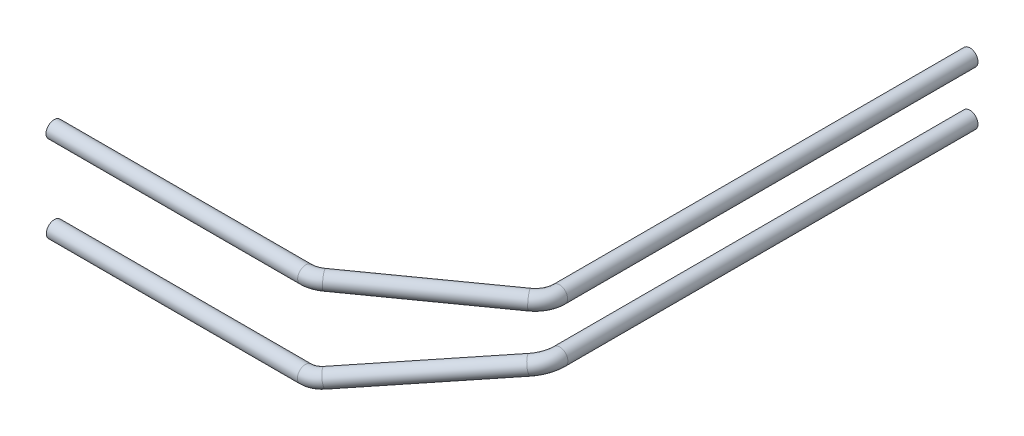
ISO-10303-21;
HEADER;
FILE_DESCRIPTION(('STEP AP214'),'2;1');
FILE_NAME('part.step','',(''),(''),'','','');
FILE_SCHEMA(('AUTOMOTIVE_DESIGN { 1 0 10303 214 1 1 1 1 }'));
ENDSEC;
DATA;
#1=APPLICATION_CONTEXT('core data for automotive mechanical design processes');
#2=APPLICATION_PROTOCOL_DEFINITION('international standard','automotive_design',2000,#1);
#3=PRODUCT_CONTEXT('',#1,'mechanical');
#4=PRODUCT('Part','Part','',(#3));
#5=PRODUCT_RELATED_PRODUCT_CATEGORY('part','',(#4));
#6=PRODUCT_DEFINITION_FORMATION('','',#4);
#7=PRODUCT_DEFINITION_CONTEXT('part definition',#1,'design');
#8=PRODUCT_DEFINITION('design','',#6,#7);
#9=PRODUCT_DEFINITION_SHAPE('','',#8);
#10=(LENGTH_UNIT() NAMED_UNIT(*) SI_UNIT(.MILLI.,.METRE.));
#11=(NAMED_UNIT(*) PLANE_ANGLE_UNIT() SI_UNIT($,.RADIAN.));
#12=(NAMED_UNIT(*) SI_UNIT($,.STERADIAN.) SOLID_ANGLE_UNIT());
#13=UNCERTAINTY_MEASURE_WITH_UNIT(LENGTH_MEASURE(1.E-05),#10,'distance_accuracy_value','');
#14=(GEOMETRIC_REPRESENTATION_CONTEXT(3) GLOBAL_UNCERTAINTY_ASSIGNED_CONTEXT((#13)) GLOBAL_UNIT_ASSIGNED_CONTEXT((#10,
#11,#12)) REPRESENTATION_CONTEXT('',''));
#15=CARTESIAN_POINT('',(0.,0.,0.));
#16=DIRECTION('',(0.,0.,1.));
#17=DIRECTION('',(1.,0.,0.));
#18=AXIS2_PLACEMENT_3D('',#15,#16,#17);
#19=CARTESIAN_POINT('',(295.260101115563,-76.2,635.));
#20=DIRECTION('',(-1.,0.,0.));
#21=DIRECTION('',(0.,-1.,0.));
#22=AXIS2_PLACEMENT_3D('',#19,#20,#21);
#23=CYLINDRICAL_SURFACE('',#22,17.399);
#24=CARTESIAN_POINT('',(-295.260101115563,-76.2,635.));
#25=DIRECTION('',(1.,0.,0.));
#26=DIRECTION('',(0.,1.,0.));
#27=AXIS2_PLACEMENT_3D('',#24,#25,#26);
#28=CIRCLE('',#27,17.399);
#29=CARTESIAN_POINT('',(-295.260101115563,-58.801,635.));
#30=VERTEX_POINT('',#29);
#31=EDGE_CURVE('E64',#30,#30,#28,.T.);
#32=ORIENTED_EDGE('',*,*,#31,.F.);
#33=EDGE_LOOP('',(#32));
#34=FACE_BOUND('',#33,.T.);
#35=CARTESIAN_POINT('',(295.260101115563,-76.2,635.));
#36=DIRECTION('',(-1.,0.,0.));
#37=DIRECTION('',(0.,-1.,0.));
#38=AXIS2_PLACEMENT_3D('',#35,#36,#37);
#39=CIRCLE('',#38,17.399);
#40=CARTESIAN_POINT('',(295.260101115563,-81.702046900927,651.506140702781));
#41=VERTEX_POINT('',#40);
#42=EDGE_CURVE('E72',#41,#41,#39,.T.);
#43=ORIENTED_EDGE('',*,*,#42,.F.);
#44=EDGE_LOOP('',(#43));
#45=FACE_BOUND('',#44,.T.);
#46=ADVANCED_FACE('F57',(#34,#45),#23,.F.);
#47=CARTESIAN_POINT('',(295.260101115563,-76.2,635.));
#48=DIRECTION('',(-1.,0.,0.));
#49=DIRECTION('',(0.,-1.,0.));
#50=AXIS2_PLACEMENT_3D('',#47,#48,#49);
#51=CYLINDRICAL_SURFACE('',#50,19.05);
#52=CARTESIAN_POINT('',(-295.260101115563,-76.2,635.));
#53=DIRECTION('',(1.,0.,0.));
#54=DIRECTION('',(0.,1.,0.));
#55=AXIS2_PLACEMENT_3D('',#52,#53,#54);
#56=CIRCLE('',#55,19.05);
#57=CARTESIAN_POINT('',(-295.260101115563,-57.1499999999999,635.));
#58=VERTEX_POINT('',#57);
#59=EDGE_CURVE('E68',#58,#58,#56,.T.);
#60=ORIENTED_EDGE('',*,*,#59,.T.);
#61=EDGE_LOOP('',(#60));
#62=FACE_BOUND('',#61,.T.);
#63=CARTESIAN_POINT('',(295.260101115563,-76.2,635.));
#64=DIRECTION('',(1.,0.,0.));
#65=DIRECTION('',(0.,1.,0.));
#66=AXIS2_PLACEMENT_3D('',#63,#64,#65);
#67=CIRCLE('',#66,19.05);
#68=CARTESIAN_POINT('',(295.260101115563,-82.2241389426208,653.072416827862));
#69=VERTEX_POINT('',#68);
#70=EDGE_CURVE('E12',#69,#69,#67,.T.);
#71=ORIENTED_EDGE('',*,*,#70,.F.);
#72=EDGE_LOOP('',(#71));
#73=FACE_BOUND('',#72,.T.);
#74=ADVANCED_FACE('F59',(#62,#73),#51,.T.);
#75=CARTESIAN_POINT('',(-295.260101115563,-76.2,635.));
#76=DIRECTION('',(1.,0.,0.));
#77=DIRECTION('',(0.,1.,0.));
#78=AXIS2_PLACEMENT_3D('',#75,#76,#77);
#79=PLANE('',#78);
#80=ORIENTED_EDGE('',*,*,#31,.T.);
#81=EDGE_LOOP('',(#80));
#82=FACE_BOUND('',#81,.T.);
#83=ORIENTED_EDGE('',*,*,#59,.F.);
#84=EDGE_LOOP('',(#83));
#85=FACE_BOUND('',#84,.T.);
#86=ADVANCED_FACE('F135',(#82,#85),#79,.F.);
#87=CARTESIAN_POINT('',(295.260101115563,-58.1275831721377,580.782749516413));
#88=DIRECTION('',(0.,0.948683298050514,0.316227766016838));
#89=DIRECTION('',(0.,-0.316227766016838,0.948683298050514));
#90=AXIS2_PLACEMENT_3D('',#87,#88,#89);
#91=TOROIDAL_SURFACE('',#90,57.15,17.399);
#92=CARTESIAN_POINT('',(329.592988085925,-72.5753351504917,624.126005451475));
#93=DIRECTION('',(-0.79943662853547,-0.189973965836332,0.569921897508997));
#94=DIRECTION('',(0.580493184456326,0.,0.814265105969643));
#95=AXIS2_PLACEMENT_3D('',#92,#93,#94);
#96=CIRCLE('',#95,17.399);
#97=CARTESIAN_POINT('',(340.045444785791,-76.9738729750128,637.321618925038));
#98=VERTEX_POINT('',#97);
#99=EDGE_CURVE('E78',#98,#98,#96,.T.);
#100=CARTESIAN_POINT('',(295.260101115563,-58.1275831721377,580.782749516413));
#101=DIRECTION('',(0.,0.948683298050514,0.316227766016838));
#102=DIRECTION('',(0.,-0.316227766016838,0.948683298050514));
#103=AXIS2_PLACEMENT_3D('',#100,#101,#102);
#104=CIRCLE('',#103,74.549);
#105=EDGE_CURVE('',#41,#98,#104,.T.);
#106=ORIENTED_EDGE('',*,*,#42,.T.);
#107=ORIENTED_EDGE('',*,*,#99,.F.);
#108=ORIENTED_EDGE('',*,*,#105,.T.);
#109=ORIENTED_EDGE('',*,*,#105,.F.);
#110=EDGE_LOOP('',(#106,#108,#107,#109));
#111=FACE_BOUND('',#110,.T.);
#112=ADVANCED_FACE('F127',(#111),#91,.F.);
#113=CARTESIAN_POINT('',(295.260101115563,-58.1275831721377,580.782749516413));
#114=DIRECTION('',(0.,0.948683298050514,0.316227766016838));
#115=DIRECTION('',(0.,-0.316227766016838,0.948683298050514));
#116=AXIS2_PLACEMENT_3D('',#113,#114,#115);
#117=TOROIDAL_SURFACE('',#116,57.15,19.05);
#118=CARTESIAN_POINT('',(329.592988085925,-72.5753351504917,624.126005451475));
#119=DIRECTION('',(-0.79943662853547,-0.189973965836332,0.569921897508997));
#120=DIRECTION('',(0.580493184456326,0.,0.814265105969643));
#121=AXIS2_PLACEMENT_3D('',#118,#119,#120);
#122=CIRCLE('',#121,19.05);
#123=CARTESIAN_POINT('',(341.037283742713,-77.3912524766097,638.573757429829));
#124=VERTEX_POINT('',#123);
#125=EDGE_CURVE('E77',#124,#124,#122,.T.);
#126=CARTESIAN_POINT('',(295.260101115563,-58.1275831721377,580.782749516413));
#127=DIRECTION('',(0.,0.948683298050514,0.316227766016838));
#128=DIRECTION('',(0.,-0.316227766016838,0.948683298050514));
#129=AXIS2_PLACEMENT_3D('',#126,#127,#128);
#130=CIRCLE('',#129,76.2);
#131=EDGE_CURVE('',#69,#124,#130,.T.);
#132=ORIENTED_EDGE('',*,*,#70,.T.);
#133=ORIENTED_EDGE('',*,*,#125,.T.);
#134=ORIENTED_EDGE('',*,*,#131,.T.);
#135=ORIENTED_EDGE('',*,*,#131,.F.);
#136=EDGE_LOOP('',(#132,#134,#133,#135));
#137=FACE_BOUND('',#136,.T.);
#138=ADVANCED_FACE('F125',(#137),#117,.T.);
#139=CARTESIAN_POINT('',(611.086952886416,-5.6825722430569,423.447716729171));
#140=DIRECTION('',(-0.79943662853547,-0.189973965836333,0.569921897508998));
#141=DIRECTION('',(0.580493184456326,0.,0.814265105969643));
#142=AXIS2_PLACEMENT_3D('',#139,#140,#141);
#143=CYLINDRICAL_SURFACE('',#142,17.399);
#144=CARTESIAN_POINT('',(611.086952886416,-5.68257224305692,423.447716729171));
#145=DIRECTION('',(-0.79943662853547,-0.189973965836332,0.569921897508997));
#146=DIRECTION('',(0.580493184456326,0.,0.814265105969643));
#147=AXIS2_PLACEMENT_3D('',#144,#145,#146);
#148=CIRCLE('',#147,17.399);
#149=CARTESIAN_POINT('',(620.734368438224,-3.3900105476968,437.744455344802));
#150=VERTEX_POINT('',#149);
#151=EDGE_CURVE('E82',#150,#150,#148,.F.);
#152=ORIENTED_EDGE('',*,*,#151,.T.);
#153=EDGE_LOOP('',(#152));
#154=FACE_BOUND('',#153,.T.);
#155=ORIENTED_EDGE('',*,*,#99,.T.);
#156=EDGE_LOOP('',(#155));
#157=FACE_BOUND('',#156,.T.);
#158=ADVANCED_FACE('F121',(#154,#157),#143,.F.);
#159=CARTESIAN_POINT('',(611.086952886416,-5.6825722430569,423.447716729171));
#160=DIRECTION('',(-0.79943662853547,-0.189973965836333,0.569921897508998));
#161=DIRECTION('',(0.580493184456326,0.,0.814265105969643));
#162=AXIS2_PLACEMENT_3D('',#159,#160,#161);
#163=CYLINDRICAL_SURFACE('',#162,19.05);
#164=CARTESIAN_POINT('',(611.086952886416,-5.68257224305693,423.447716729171));
#165=DIRECTION('',(0.79943662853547,0.189973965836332,-0.569921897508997));
#166=DIRECTION('',(-0.580493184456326,0.,-0.814265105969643));
#167=AXIS2_PLACEMENT_3D('',#164,#165,#166);
#168=CIRCLE('',#167,19.05);
#169=CARTESIAN_POINT('',(621.649816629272,-3.1724681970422,439.101080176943));
#170=VERTEX_POINT('',#169);
#171=EDGE_CURVE('E81',#170,#170,#168,.T.);
#172=ORIENTED_EDGE('',*,*,#171,.F.);
#173=EDGE_LOOP('',(#172));
#174=FACE_BOUND('',#173,.T.);
#175=ORIENTED_EDGE('',*,*,#125,.F.);
#176=EDGE_LOOP('',(#175));
#177=FACE_BOUND('',#176,.T.);
#178=ADVANCED_FACE('F118',(#174,#177),#163,.T.);
#179=CARTESIAN_POINT('',(579.398361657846,-13.2128843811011,376.487626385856));
#180=DIRECTION('',(0.231196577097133,-0.972907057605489,0.));
#181=DIRECTION('',(0.972907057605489,0.231196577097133,0.));
#182=AXIS2_PLACEMENT_3D('',#179,#180,#181);
#183=TOROIDAL_SURFACE('',#182,57.1499999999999,17.399);
#184=CARTESIAN_POINT('',(635.,0.,376.487626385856));
#185=DIRECTION('',(0.,0.,-1.));
#186=DIRECTION('',(-1.,0.,0.));
#187=AXIS2_PLACEMENT_3D('',#184,#185,#186);
#188=CIRCLE('',#187,17.399);
#189=CARTESIAN_POINT('',(651.927609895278,4.02258924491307,376.487626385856));
#190=VERTEX_POINT('',#189);
#191=EDGE_CURVE('E89',#190,#190,#188,.F.);
#192=CARTESIAN_POINT('',(579.398361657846,-13.2128843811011,376.487626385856));
#193=DIRECTION('',(0.231196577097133,-0.972907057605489,0.));
#194=DIRECTION('',(0.972907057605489,0.231196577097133,0.));
#195=AXIS2_PLACEMENT_3D('',#192,#193,#194);
#196=CIRCLE('',#195,74.5489999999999);
#197=EDGE_CURVE('',#190,#150,#196,.T.);
#198=ORIENTED_EDGE('',*,*,#191,.F.);
#199=ORIENTED_EDGE('',*,*,#151,.F.);
#200=ORIENTED_EDGE('',*,*,#197,.T.);
#201=ORIENTED_EDGE('',*,*,#197,.F.);
#202=EDGE_LOOP('',(#198,#200,#199,#201));
#203=FACE_BOUND('',#202,.T.);
#204=ADVANCED_FACE('F114',(#203),#183,.F.);
#205=CARTESIAN_POINT('',(579.398361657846,-13.2128843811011,376.487626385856));
#206=DIRECTION('',(0.231196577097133,-0.972907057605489,0.));
#207=DIRECTION('',(0.972907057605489,0.231196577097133,0.));
#208=AXIS2_PLACEMENT_3D('',#205,#206,#207);
#209=TOROIDAL_SURFACE('',#208,57.1499999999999,19.05);
#210=CARTESIAN_POINT('',(635.,0.,376.487626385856));
#211=DIRECTION('',(0.,0.,-1.));
#212=DIRECTION('',(-1.,0.,0.));
#213=AXIS2_PLACEMENT_3D('',#210,#211,#212);
#214=CIRCLE('',#213,19.05);
#215=CARTESIAN_POINT('',(653.533879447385,4.40429479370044,376.487626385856));
#216=VERTEX_POINT('',#215);
#217=EDGE_CURVE('E90',#216,#216,#214,.T.);
#218=CARTESIAN_POINT('',(579.398361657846,-13.2128843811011,376.487626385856));
#219=DIRECTION('',(0.231196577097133,-0.972907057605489,0.));
#220=DIRECTION('',(0.972907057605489,0.231196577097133,0.));
#221=AXIS2_PLACEMENT_3D('',#218,#219,#220);
#222=CIRCLE('',#221,76.2);
#223=EDGE_CURVE('',#216,#170,#222,.T.);
#224=ORIENTED_EDGE('',*,*,#217,.F.);
#225=ORIENTED_EDGE('',*,*,#171,.T.);
#226=ORIENTED_EDGE('',*,*,#223,.T.);
#227=ORIENTED_EDGE('',*,*,#223,.F.);
#228=EDGE_LOOP('',(#224,#226,#225,#227));
#229=FACE_BOUND('',#228,.T.);
#230=ADVANCED_FACE('F111',(#229),#209,.T.);
#231=CARTESIAN_POINT('',(635.,0.,-588.434813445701));
#232=DIRECTION('',(0.,0.,1.));
#233=DIRECTION('',(0.,-1.,0.));
#234=AXIS2_PLACEMENT_3D('',#231,#232,#233);
#235=CYLINDRICAL_SURFACE('',#234,17.399);
#236=CARTESIAN_POINT('',(635.,0.,-588.434813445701));
#237=DIRECTION('',(0.,0.,-1.));
#238=DIRECTION('',(-0.159334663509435,0.987224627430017,0.));
#239=AXIS2_PLACEMENT_3D('',#236,#237,#238);
#240=CIRCLE('',#239,17.399);
#241=CARTESIAN_POINT('',(632.227736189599,17.1767212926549,-588.434813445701));
#242=VERTEX_POINT('',#241);
#243=EDGE_CURVE('E96',#242,#242,#240,.T.);
#244=ORIENTED_EDGE('',*,*,#243,.T.);
#245=EDGE_LOOP('',(#244));
#246=FACE_BOUND('',#245,.T.);
#247=ORIENTED_EDGE('',*,*,#191,.T.);
#248=EDGE_LOOP('',(#247));
#249=FACE_BOUND('',#248,.T.);
#250=ADVANCED_FACE('F107',(#246,#249),#235,.F.);
#251=CARTESIAN_POINT('',(635.,0.,-588.434813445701));
#252=DIRECTION('',(0.,0.,1.));
#253=DIRECTION('',(0.,-1.,0.));
#254=AXIS2_PLACEMENT_3D('',#251,#252,#253);
#255=CYLINDRICAL_SURFACE('',#254,19.05);
#256=CARTESIAN_POINT('',(635.,0.,-588.434813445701));
#257=DIRECTION('',(0.,0.,-1.));
#258=DIRECTION('',(-0.159334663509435,0.987224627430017,0.));
#259=AXIS2_PLACEMENT_3D('',#256,#257,#258);
#260=CIRCLE('',#259,19.05);
#261=CARTESIAN_POINT('',(631.964674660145,18.8066291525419,-588.434813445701));
#262=VERTEX_POINT('',#261);
#263=EDGE_CURVE('E93',#262,#262,#260,.T.);
#264=ORIENTED_EDGE('',*,*,#263,.F.);
#265=EDGE_LOOP('',(#264));
#266=FACE_BOUND('',#265,.T.);
#267=ORIENTED_EDGE('',*,*,#217,.T.);
#268=EDGE_LOOP('',(#267));
#269=FACE_BOUND('',#268,.T.);
#270=ADVANCED_FACE('F104',(#266,#269),#255,.T.);
#271=CARTESIAN_POINT('',(635.,0.,-588.434813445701));
#272=DIRECTION('',(0.,0.,-1.));
#273=DIRECTION('',(-0.159334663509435,0.987224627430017,0.));
#274=AXIS2_PLACEMENT_3D('',#271,#272,#273);
#275=PLANE('',#274);
#276=ORIENTED_EDGE('',*,*,#243,.F.);
#277=EDGE_LOOP('',(#276));
#278=FACE_BOUND('',#277,.T.);
#279=ORIENTED_EDGE('',*,*,#263,.T.);
#280=EDGE_LOOP('',(#279));
#281=FACE_BOUND('',#280,.T.);
#282=ADVANCED_FACE('F102',(#278,#281),#275,.T.);
#283=CLOSED_SHELL('',(#46,#74,#86,#112,#138,#158,#178,#204,#230,#250,#270,#282));
#284=MANIFOLD_SOLID_BREP('B2',#283);
#285=CARTESIAN_POINT('',(296.054155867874,127.,635.));
#286=DIRECTION('',(-1.,0.,0.));
#287=DIRECTION('',(0.,-1.,0.));
#288=AXIS2_PLACEMENT_3D('',#285,#286,#287);
#289=CYLINDRICAL_SURFACE('',#288,17.399);
#290=CARTESIAN_POINT('',(-296.006811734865,127.,635.));
#291=DIRECTION('',(1.,0.,0.));
#292=DIRECTION('',(0.,1.,0.));
#293=AXIS2_PLACEMENT_3D('',#290,#291,#292);
#294=CIRCLE('',#293,17.399);
#295=CARTESIAN_POINT('',(-296.006811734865,144.399,635.));
#296=VERTEX_POINT('',#295);
#297=EDGE_CURVE('E294',#296,#296,#294,.T.);
#298=ORIENTED_EDGE('',*,*,#297,.F.);
#299=EDGE_LOOP('',(#298));
#300=FACE_BOUND('',#299,.T.);
#301=CARTESIAN_POINT('',(296.054155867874,127.,635.));
#302=DIRECTION('',(-1.,0.,0.));
#303=DIRECTION('',(0.,-1.,0.));
#304=AXIS2_PLACEMENT_3D('',#301,#302,#303);
#305=CIRCLE('',#304,17.399);
#306=CARTESIAN_POINT('',(296.054155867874,127.,652.399));
#307=VERTEX_POINT('',#306);
#308=EDGE_CURVE('E302',#307,#307,#305,.T.);
#309=ORIENTED_EDGE('',*,*,#308,.F.);
#310=EDGE_LOOP('',(#309));
#311=FACE_BOUND('',#310,.T.);
#312=ADVANCED_FACE('F287',(#300,#311),#289,.F.);
#313=CARTESIAN_POINT('',(296.054155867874,127.,635.));
#314=DIRECTION('',(-1.,0.,0.));
#315=DIRECTION('',(0.,-1.,0.));
#316=AXIS2_PLACEMENT_3D('',#313,#314,#315);
#317=CYLINDRICAL_SURFACE('',#316,19.05);
#318=CARTESIAN_POINT('',(-296.006811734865,127.,635.));
#319=DIRECTION('',(1.,0.,0.));
#320=DIRECTION('',(0.,1.,0.));
#321=AXIS2_PLACEMENT_3D('',#318,#319,#320);
#322=CIRCLE('',#321,19.05);
#323=CARTESIAN_POINT('',(-296.006811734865,146.05,635.));
#324=VERTEX_POINT('',#323);
#325=EDGE_CURVE('E298',#324,#324,#322,.T.);
#326=ORIENTED_EDGE('',*,*,#325,.T.);
#327=EDGE_LOOP('',(#326));
#328=FACE_BOUND('',#327,.T.);
#329=CARTESIAN_POINT('',(296.054155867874,127.,635.));
#330=DIRECTION('',(1.,0.,0.));
#331=DIRECTION('',(0.,1.,0.));
#332=AXIS2_PLACEMENT_3D('',#329,#330,#331);
#333=CIRCLE('',#332,19.05);
#334=CARTESIAN_POINT('',(296.054155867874,127.,654.05));
#335=VERTEX_POINT('',#334);
#336=EDGE_CURVE('E56',#335,#335,#333,.T.);
#337=ORIENTED_EDGE('',*,*,#336,.F.);
#338=EDGE_LOOP('',(#337));
#339=FACE_BOUND('',#338,.T.);
#340=ADVANCED_FACE('F289',(#328,#339),#317,.T.);
#341=CARTESIAN_POINT('',(-296.006811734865,127.,635.));
#342=DIRECTION('',(1.,0.,0.));
#343=DIRECTION('',(0.,1.,0.));
#344=AXIS2_PLACEMENT_3D('',#341,#342,#343);
#345=PLANE('',#344);
#346=ORIENTED_EDGE('',*,*,#297,.T.);
#347=EDGE_LOOP('',(#346));
#348=FACE_BOUND('',#347,.T.);
#349=ORIENTED_EDGE('',*,*,#325,.F.);
#350=EDGE_LOOP('',(#349));
#351=FACE_BOUND('',#350,.T.);
#352=ADVANCED_FACE('F365',(#348,#351),#345,.F.);
#353=CARTESIAN_POINT('',(296.054155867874,127.,577.85));
#354=DIRECTION('',(0.,1.,0.));
#355=DIRECTION('',(0.,0.,1.));
#356=AXIS2_PLACEMENT_3D('',#353,#354,#355);
#357=TOROIDAL_SURFACE('',#356,57.15,17.399);
#358=CARTESIAN_POINT('',(329.229341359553,127.,624.385250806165));
#359=DIRECTION('',(-0.814265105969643,0.,0.580493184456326));
#360=DIRECTION('',(0.580493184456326,0.,0.814265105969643));
#361=AXIS2_PLACEMENT_3D('',#358,#359,#360);
#362=CIRCLE('',#361,17.399);
#363=CARTESIAN_POINT('',(339.329342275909,127.,638.552649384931));
#364=VERTEX_POINT('',#363);
#365=EDGE_CURVE('E308',#364,#364,#362,.T.);
#366=CARTESIAN_POINT('',(296.054155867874,127.,577.85));
#367=DIRECTION('',(0.,1.,0.));
#368=DIRECTION('',(0.,0.,1.));
#369=AXIS2_PLACEMENT_3D('',#366,#367,#368);
#370=CIRCLE('',#369,74.5490000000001);
#371=EDGE_CURVE('',#307,#364,#370,.T.);
#372=ORIENTED_EDGE('',*,*,#308,.T.);
#373=ORIENTED_EDGE('',*,*,#365,.F.);
#374=ORIENTED_EDGE('',*,*,#371,.T.);
#375=ORIENTED_EDGE('',*,*,#371,.F.);
#376=EDGE_LOOP('',(#372,#374,#373,#375));
#377=FACE_BOUND('',#376,.T.);
#378=ADVANCED_FACE('F357',(#377),#357,.F.);
#379=CARTESIAN_POINT('',(296.054155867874,127.,577.85));
#380=DIRECTION('',(0.,1.,0.));
#381=DIRECTION('',(0.,0.,1.));
#382=AXIS2_PLACEMENT_3D('',#379,#380,#381);
#383=TOROIDAL_SURFACE('',#382,57.15,19.05);
#384=CARTESIAN_POINT('',(329.229341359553,127.,624.385250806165));
#385=DIRECTION('',(-0.814265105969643,0.,0.580493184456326));
#386=DIRECTION('',(0.580493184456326,0.,0.814265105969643));
#387=AXIS2_PLACEMENT_3D('',#384,#385,#386);
#388=CIRCLE('',#387,19.05);
#389=CARTESIAN_POINT('',(340.287736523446,127.,639.897001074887));
#390=VERTEX_POINT('',#389);
#391=EDGE_CURVE('E307',#390,#390,#388,.T.);
#392=CARTESIAN_POINT('',(296.054155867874,127.,577.85));
#393=DIRECTION('',(0.,1.,0.));
#394=DIRECTION('',(0.,0.,1.));
#395=AXIS2_PLACEMENT_3D('',#392,#393,#394);
#396=CIRCLE('',#395,76.2000000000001);
#397=EDGE_CURVE('',#335,#390,#396,.T.);
#398=ORIENTED_EDGE('',*,*,#336,.T.);
#399=ORIENTED_EDGE('',*,*,#391,.T.);
#400=ORIENTED_EDGE('',*,*,#397,.T.);
#401=ORIENTED_EDGE('',*,*,#397,.F.);
#402=EDGE_LOOP('',(#398,#400,#399,#401));
#403=FACE_BOUND('',#402,.T.);
#404=ADVANCED_FACE('F355',(#403),#383,.T.);
#405=CARTESIAN_POINT('',(611.025185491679,127.,423.491750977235));
#406=DIRECTION('',(-0.814265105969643,0.,0.580493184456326));
#407=DIRECTION('',(0.580493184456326,0.,0.814265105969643));
#408=AXIS2_PLACEMENT_3D('',#405,#406,#407);
#409=CYLINDRICAL_SURFACE('',#408,17.399);
#410=CARTESIAN_POINT('',(611.025185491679,127.,423.491750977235));
#411=DIRECTION('',(-0.814265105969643,0.,0.580493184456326));
#412=DIRECTION('',(0.580493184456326,0.,0.814265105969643));
#413=AXIS2_PLACEMENT_3D('',#410,#411,#412);
#414=CIRCLE('',#413,17.399);
#415=CARTESIAN_POINT('',(621.125186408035,127.,437.659149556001));
#416=VERTEX_POINT('',#415);
#417=EDGE_CURVE('E312',#416,#416,#414,.T.);
#418=ORIENTED_EDGE('',*,*,#417,.F.);
#419=EDGE_LOOP('',(#418));
#420=FACE_BOUND('',#419,.T.);
#421=ORIENTED_EDGE('',*,*,#365,.T.);
#422=EDGE_LOOP('',(#421));
#423=FACE_BOUND('',#422,.T.);
#424=ADVANCED_FACE('F351',(#420,#423),#409,.F.);
#425=CARTESIAN_POINT('',(611.025185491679,127.,423.491750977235));
#426=DIRECTION('',(-0.814265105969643,0.,0.580493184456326));
#427=DIRECTION('',(0.580493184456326,0.,0.814265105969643));
#428=AXIS2_PLACEMENT_3D('',#425,#426,#427);
#429=CYLINDRICAL_SURFACE('',#428,19.05);
#430=CARTESIAN_POINT('',(611.025185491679,127.,423.491750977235));
#431=DIRECTION('',(0.814265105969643,0.,-0.580493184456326));
#432=DIRECTION('',(-0.580493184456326,0.,-0.814265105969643));
#433=AXIS2_PLACEMENT_3D('',#430,#431,#432);
#434=CIRCLE('',#433,19.05);
#435=CARTESIAN_POINT('',(622.083580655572,127.,439.003501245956));
#436=VERTEX_POINT('',#435);
#437=EDGE_CURVE('E311',#436,#436,#434,.T.);
#438=ORIENTED_EDGE('',*,*,#437,.F.);
#439=EDGE_LOOP('',(#438));
#440=FACE_BOUND('',#439,.T.);
#441=ORIENTED_EDGE('',*,*,#391,.F.);
#442=EDGE_LOOP('',(#441));
#443=FACE_BOUND('',#442,.T.);
#444=ADVANCED_FACE('F348',(#440,#443),#429,.T.);
#445=CARTESIAN_POINT('',(577.85,127.,376.95650017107));
#446=DIRECTION('',(0.,1.,0.));
#447=DIRECTION('',(0.,0.,1.));
#448=AXIS2_PLACEMENT_3D('',#445,#446,#447);
#449=TOROIDAL_SURFACE('',#448,57.1499999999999,17.399);
#450=CARTESIAN_POINT('',(635.,127.,376.95650017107));
#451=DIRECTION('',(0.,0.,1.));
#452=DIRECTION('',(1.,0.,0.));
#453=AXIS2_PLACEMENT_3D('',#450,#451,#452);
#454=CIRCLE('',#453,17.399);
#455=CARTESIAN_POINT('',(652.399,127.,376.95650017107));
#456=VERTEX_POINT('',#455);
#457=EDGE_CURVE('E320',#456,#456,#454,.T.);
#458=CARTESIAN_POINT('',(577.85,127.,376.95650017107));
#459=DIRECTION('',(0.,1.,0.));
#460=DIRECTION('',(0.,0.,1.));
#461=AXIS2_PLACEMENT_3D('',#458,#459,#460);
#462=CIRCLE('',#461,74.5489999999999);
#463=EDGE_CURVE('',#416,#456,#462,.T.);
#464=ORIENTED_EDGE('',*,*,#417,.T.);
#465=ORIENTED_EDGE('',*,*,#457,.F.);
#466=ORIENTED_EDGE('',*,*,#463,.T.);
#467=ORIENTED_EDGE('',*,*,#463,.F.);
#468=EDGE_LOOP('',(#464,#466,#465,#467));
#469=FACE_BOUND('',#468,.T.);
#470=ADVANCED_FACE('F344',(#469),#449,.F.);
#471=CARTESIAN_POINT('',(577.85,127.,376.95650017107));
#472=DIRECTION('',(0.,1.,0.));
#473=DIRECTION('',(0.,0.,1.));
#474=AXIS2_PLACEMENT_3D('',#471,#472,#473);
#475=TOROIDAL_SURFACE('',#474,57.1499999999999,19.05);
#476=CARTESIAN_POINT('',(635.,127.,376.95650017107));
#477=DIRECTION('',(0.,0.,1.));
#478=DIRECTION('',(1.,0.,0.));
#479=AXIS2_PLACEMENT_3D('',#476,#477,#478);
#480=CIRCLE('',#479,19.05);
#481=CARTESIAN_POINT('',(654.05,127.,376.95650017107));
#482=VERTEX_POINT('',#481);
#483=EDGE_CURVE('E319',#482,#482,#480,.T.);
#484=CARTESIAN_POINT('',(577.85,127.,376.95650017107));
#485=DIRECTION('',(0.,1.,0.));
#486=DIRECTION('',(0.,0.,1.));
#487=AXIS2_PLACEMENT_3D('',#484,#485,#486);
#488=CIRCLE('',#487,76.2);
#489=EDGE_CURVE('',#436,#482,#488,.T.);
#490=ORIENTED_EDGE('',*,*,#437,.T.);
#491=ORIENTED_EDGE('',*,*,#483,.T.);
#492=ORIENTED_EDGE('',*,*,#489,.T.);
#493=ORIENTED_EDGE('',*,*,#489,.F.);
#494=EDGE_LOOP('',(#490,#492,#491,#493));
#495=FACE_BOUND('',#494,.T.);
#496=ADVANCED_FACE('F341',(#495),#475,.T.);
#497=CARTESIAN_POINT('',(635.,127.,-588.434813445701));
#498=DIRECTION('',(0.,0.,1.));
#499=DIRECTION('',(1.,0.,0.));
#500=AXIS2_PLACEMENT_3D('',#497,#498,#499);
#501=CYLINDRICAL_SURFACE('',#500,17.399);
#502=CARTESIAN_POINT('',(635.,127.,-588.434813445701));
#503=DIRECTION('',(0.,0.,-1.));
#504=DIRECTION('',(0.,1.,0.));
#505=AXIS2_PLACEMENT_3D('',#502,#503,#504);
#506=CIRCLE('',#505,17.399);
#507=CARTESIAN_POINT('',(635.,144.399,-588.434813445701));
#508=VERTEX_POINT('',#507);
#509=EDGE_CURVE('E324',#508,#508,#506,.T.);
#510=ORIENTED_EDGE('',*,*,#509,.T.);
#511=EDGE_LOOP('',(#510));
#512=FACE_BOUND('',#511,.T.);
#513=ORIENTED_EDGE('',*,*,#457,.T.);
#514=EDGE_LOOP('',(#513));
#515=FACE_BOUND('',#514,.T.);
#516=ADVANCED_FACE('F337',(#512,#515),#501,.F.);
#517=CARTESIAN_POINT('',(635.,127.,-588.434813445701));
#518=DIRECTION('',(0.,0.,1.));
#519=DIRECTION('',(1.,0.,0.));
#520=AXIS2_PLACEMENT_3D('',#517,#518,#519);
#521=CYLINDRICAL_SURFACE('',#520,19.05);
#522=CARTESIAN_POINT('',(635.,127.,-588.434813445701));
#523=DIRECTION('',(0.,0.,-1.));
#524=DIRECTION('',(0.,1.,0.));
#525=AXIS2_PLACEMENT_3D('',#522,#523,#524);
#526=CIRCLE('',#525,19.05);
#527=CARTESIAN_POINT('',(635.,146.05,-588.434813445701));
#528=VERTEX_POINT('',#527);
#529=EDGE_CURVE('E323',#528,#528,#526,.T.);
#530=ORIENTED_EDGE('',*,*,#529,.F.);
#531=EDGE_LOOP('',(#530));
#532=FACE_BOUND('',#531,.T.);
#533=ORIENTED_EDGE('',*,*,#483,.F.);
#534=EDGE_LOOP('',(#533));
#535=FACE_BOUND('',#534,.T.);
#536=ADVANCED_FACE('F334',(#532,#535),#521,.T.);
#537=CARTESIAN_POINT('',(635.,127.,-588.434813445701));
#538=DIRECTION('',(0.,0.,-1.));
#539=DIRECTION('',(0.,1.,0.));
#540=AXIS2_PLACEMENT_3D('',#537,#538,#539);
#541=PLANE('',#540);
#542=ORIENTED_EDGE('',*,*,#509,.F.);
#543=EDGE_LOOP('',(#542));
#544=FACE_BOUND('',#543,.T.);
#545=ORIENTED_EDGE('',*,*,#529,.T.);
#546=EDGE_LOOP('',(#545));
#547=FACE_BOUND('',#546,.T.);
#548=ADVANCED_FACE('F332',(#544,#547),#541,.T.);
#549=CLOSED_SHELL('',(#312,#340,#352,#378,#404,#424,#444,#470,#496,#516,#536,#548));
#550=MANIFOLD_SOLID_BREP('B7',#549);
#551=ADVANCED_BREP_SHAPE_REPRESENTATION('',(#18,#284,#550),#14);
#552=SHAPE_DEFINITION_REPRESENTATION(#9,#551);
ENDSEC;
END-ISO-10303-21;
